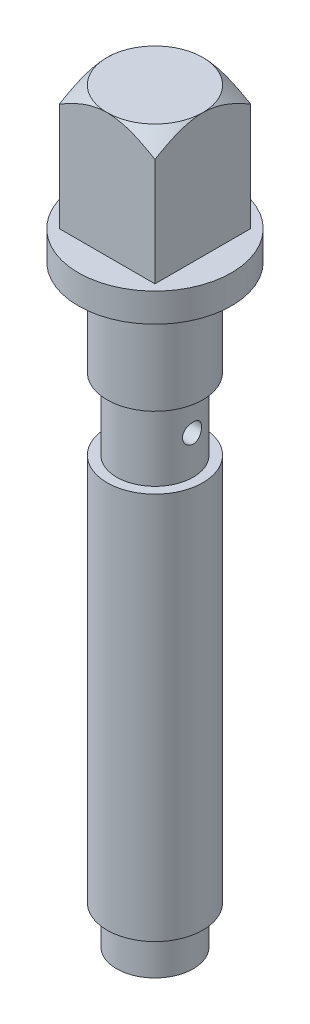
from build123d import *

# Parameters (mm, degrees)
SKETCH2_R               = 4
BOSS_EXTRUDE1_DEPTH     = 4
SKETCH3_R               = 5
BOSS_EXTRUDE2_DEPTH     = 40.5
SKETCH4_R               = 4
BOSS_EXTRUDE3_DEPTH     = 7.5
CUT_EXTRUDE1_DEPTH      = 7.5
CUT_EXTRUDE1_DEPTH_BACK = 7.5
SKETCH5_R               = 1
SKETCH6_R               = 5
BOSS_EXTRUDE4_DEPTH     = 10
SKETCH7_R               = 8
BOSS_EXTRUDE5_DEPTH     = 3
SKETCH8_W               = 10
SKETCH8_H               = 10
BOSS_EXTRUDE6_DEPTH     = 13
SKETCH9_OUTSIDE_W       = 39.01
SKETCH9_OUTSIDE_H       = 39.01
SKETCH9_OUTSIDE_R       = 5
CUT_EXTRUDE3_DEPTH      = 2
CUT_EXTRUDE3_DRAFT      = -50


with BuildPart() as part:
    # Sketch2 → Boss-Extrude1 (new body)
    with BuildSketch(Plane(origin=(0, 0, 0), x_dir=(1, 0, 0), z_dir=(0, 1, 0))):
        with Locations(Location((0, 0, 0), (0, 0, 270))):
            Circle(SKETCH2_R)
    extrude(amount=BOSS_EXTRUDE1_DEPTH)

    # Sketch3 → Boss-Extrude2 (add)
    with BuildSketch(Plane(origin=(0, 4, 0), x_dir=(1, 0, 0), z_dir=(0, 1, 0))):
        with Locations(Location((0, 0, 0), (0, 0, 270))):
            Circle(SKETCH3_R)
    extrude(amount=BOSS_EXTRUDE2_DEPTH)

    # Sketch4 → Boss-Extrude3 (add)
    with BuildSketch(Plane(origin=(0, 44.5, 0), x_dir=(1, 0, 0), z_dir=(0, 1, 0))):
        with Locations(Location((0, 0, 0), (0, 0, 270))):
            Circle(SKETCH4_R)
    extrude(amount=BOSS_EXTRUDE3_DEPTH)

    # Sketch5 → Cut-Extrude1 (cut, two sides: drawn at the far end of the back side and taken through both)
    with BuildSketch(Plane(origin=(0, 0, 0), x_dir=(0, 0, -1), z_dir=(1, 0, 0)).offset(-CUT_EXTRUDE1_DEPTH_BACK)):
        with Locations(Location((0, 48.5, 0), (0, 0, 180))):
            Circle(SKETCH5_R)
    extrude(amount=CUT_EXTRUDE1_DEPTH + CUT_EXTRUDE1_DEPTH_BACK, mode=Mode.SUBTRACT)

    # Sketch6 → Boss-Extrude4 (add)
    with BuildSketch(Plane(origin=(0, 52, 0), x_dir=(1, 0, 0), z_dir=(0, 1, 0))):
        with Locations(Location((0, 0, 0), (0, 0, 270))):
            Circle(SKETCH6_R)
    extrude(amount=BOSS_EXTRUDE4_DEPTH)

    # Sketch7 → Boss-Extrude5 (add)
    with BuildSketch(Plane(origin=(0, 62, 0), x_dir=(1, 0, 0), z_dir=(0, 1, 0))):
        with Locations(Location((0, 0, 0), (0, 0, 270))):
            Circle(SKETCH7_R)
    extrude(amount=BOSS_EXTRUDE5_DEPTH)

    # Sketch8 → Boss-Extrude6 (add)
    with BuildSketch(Plane(origin=(0, 65, 0), x_dir=(1, 0, 0), z_dir=(0, 1, 0))):
        Rectangle(SKETCH8_W, SKETCH8_H)
    extrude(amount=BOSS_EXTRUDE6_DEPTH)


with BuildPart() as cut_extrude3_tool:
    # Sketch9 outside → Cut-Extrude3 (with draft: the straight prism first)
    with BuildSketch(Plane(origin=(0, 78, 0), x_dir=(1, 0, 0), z_dir=(0, 1, 0))):
        Rectangle(SKETCH9_OUTSIDE_W, SKETCH9_OUTSIDE_H)
        with Locations(Location((0, 0, 0), (0, 0, 270))):
            Circle(SKETCH9_OUTSIDE_R, mode=Mode.SUBTRACT)
    extrude(amount=-CUT_EXTRUDE3_DEPTH)
    # Cut-Extrude3: the draft: its side faces are tilted about the plane it starts from
    cut_extrude3_sides = [cut_extrude3_tool.faces().sort_by_distance(p)[0] for p in [
        (0, 77, 19.505),
        (19.505, 77, 0),
        (0, 77, -19.505),
        (-19.505, 77, 0),
        (0, 77, -5),
    ]]
    draft(cut_extrude3_sides, Plane(origin=(0, 78, 0), x_dir=(1, 0, 0), z_dir=(0, 1, 0)), CUT_EXTRUDE3_DRAFT)


with BuildPart() as part_1:
    add(part.part)

    # Cut-Extrude3: cut by cut_extrude3_tool
    add(cut_extrude3_tool.part, mode=Mode.SUBTRACT)


solid = part_1.part
